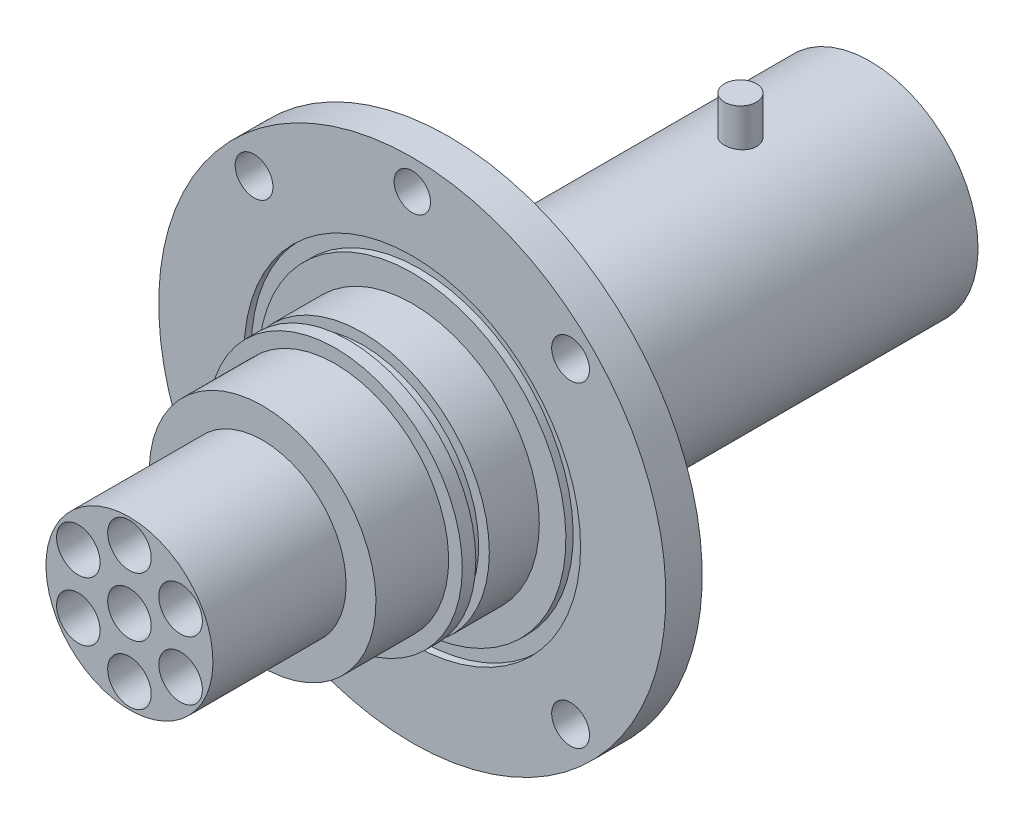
ISO-10303-21;
HEADER;
FILE_DESCRIPTION(('STEP AP214'),'2;1');
FILE_NAME('part.step','',(''),(''),'','','');
FILE_SCHEMA(('AUTOMOTIVE_DESIGN { 1 0 10303 214 1 1 1 1 }'));
ENDSEC;
DATA;
#1=APPLICATION_CONTEXT('core data for automotive mechanical design processes');
#2=APPLICATION_PROTOCOL_DEFINITION('international standard','automotive_design',2000,#1);
#3=PRODUCT_CONTEXT('',#1,'mechanical');
#4=PRODUCT('Part','Part','',(#3));
#5=PRODUCT_RELATED_PRODUCT_CATEGORY('part','',(#4));
#6=PRODUCT_DEFINITION_FORMATION('','',#4);
#7=PRODUCT_DEFINITION_CONTEXT('part definition',#1,'design');
#8=PRODUCT_DEFINITION('design','',#6,#7);
#9=PRODUCT_DEFINITION_SHAPE('','',#8);
#10=(LENGTH_UNIT() NAMED_UNIT(*) SI_UNIT(.MILLI.,.METRE.));
#11=(NAMED_UNIT(*) PLANE_ANGLE_UNIT() SI_UNIT($,.RADIAN.));
#12=(NAMED_UNIT(*) SI_UNIT($,.STERADIAN.) SOLID_ANGLE_UNIT());
#13=UNCERTAINTY_MEASURE_WITH_UNIT(LENGTH_MEASURE(1.E-05),#10,'distance_accuracy_value','');
#14=(GEOMETRIC_REPRESENTATION_CONTEXT(3) GLOBAL_UNCERTAINTY_ASSIGNED_CONTEXT((#13)) GLOBAL_UNIT_ASSIGNED_CONTEXT((#10,
#11,#12)) REPRESENTATION_CONTEXT('',''));
#15=CARTESIAN_POINT('',(0.,0.,0.));
#16=DIRECTION('',(0.,0.,1.));
#17=DIRECTION('',(1.,0.,0.));
#18=AXIS2_PLACEMENT_3D('',#15,#16,#17);
#19=CARTESIAN_POINT('',(0.,0.,0.));
#20=DIRECTION('',(0.,0.,-1.));
#21=DIRECTION('',(0.,1.,0.));
#22=AXIS2_PLACEMENT_3D('',#19,#20,#21);
#23=CYLINDRICAL_SURFACE('',#22,18.8722);
#24=CARTESIAN_POINT('',(0.,0.,-80.01));
#25=DIRECTION('',(0.,0.,-1.));
#26=DIRECTION('',(0.,1.,0.));
#27=AXIS2_PLACEMENT_3D('',#24,#25,#26);
#28=CIRCLE('',#27,18.8722);
#29=CARTESIAN_POINT('',(0.,18.8722,-80.01));
#30=VERTEX_POINT('',#29);
#31=EDGE_CURVE('E78',#30,#30,#28,.T.);
#32=ORIENTED_EDGE('',*,*,#31,.F.);
#33=EDGE_LOOP('',(#32));
#34=FACE_BOUND('',#33,.T.);
#35=CARTESIAN_POINT('',(0.,0.,-14.6812));
#36=DIRECTION('',(0.,0.,-1.));
#37=DIRECTION('',(0.,1.,0.));
#38=AXIS2_PLACEMENT_3D('',#35,#36,#37);
#39=CIRCLE('',#38,18.8722);
#40=CARTESIAN_POINT('',(0.,18.8722,-14.6812));
#41=VERTEX_POINT('',#40);
#42=EDGE_CURVE('E81',#41,#41,#39,.T.);
#43=ORIENTED_EDGE('',*,*,#42,.T.);
#44=EDGE_LOOP('',(#43));
#45=FACE_BOUND('',#44,.T.);
#46=CARTESIAN_POINT('',(0.,18.8722,-54.5592));
#47=CARTESIAN_POINT('',(-0.15602528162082,18.8721975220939,-54.55920645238));
#48=CARTESIAN_POINT('',(-0.312141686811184,18.8702448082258,-54.5723134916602));
#49=CARTESIAN_POINT('',(-0.62001245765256,18.8626429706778,-54.6243830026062));
#50=CARTESIAN_POINT('',(-0.771762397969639,18.8569902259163,-54.6633708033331));
#51=CARTESIAN_POINT('',(-1.06640004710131,18.8426237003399,-54.7660127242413));
#52=CARTESIAN_POINT('',(-1.20929429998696,18.8339122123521,-54.8296483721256));
#53=CARTESIAN_POINT('',(-1.48235401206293,18.8143913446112,-54.9797348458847));
#54=CARTESIAN_POINT('',(-1.61252127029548,18.8035822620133,-55.0661824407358));
#55=CARTESIAN_POINT('',(-1.85744592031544,18.7809765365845,-55.2601407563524));
#56=CARTESIAN_POINT('',(-1.97209231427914,18.7691736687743,-55.3677909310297));
#57=CARTESIAN_POINT('',(-2.18176331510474,18.745959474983,-55.6007985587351));
#58=CARTESIAN_POINT('',(-2.27678680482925,18.7345481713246,-55.726157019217));
#59=CARTESIAN_POINT('',(-2.44494522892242,18.7133486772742,-55.9917665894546));
#60=CARTESIAN_POINT('',(-2.51797304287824,18.7035685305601,-56.1320862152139));
#61=CARTESIAN_POINT('',(-2.63938260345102,18.6868234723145,-56.4231683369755));
#62=CARTESIAN_POINT('',(-2.68776565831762,18.6798584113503,-56.5739302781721));
#63=CARTESIAN_POINT('',(-2.75816815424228,18.6695932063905,-56.880451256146));
#64=CARTESIAN_POINT('',(-2.78037742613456,18.6662666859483,-57.036165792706));
#65=CARTESIAN_POINT('',(-2.79838993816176,18.6635750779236,-57.3491443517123));
#66=CARTESIAN_POINT('',(-2.794194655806,18.6642097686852,-57.506408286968));
#67=CARTESIAN_POINT('',(-2.75967233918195,18.669344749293,-57.8166820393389));
#68=CARTESIAN_POINT('',(-2.72955653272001,18.673813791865,-57.9697159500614));
#69=CARTESIAN_POINT('',(-2.64437860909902,18.686065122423,-58.268534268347));
#70=CARTESIAN_POINT('',(-2.58931580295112,18.6938475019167,-58.4143184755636));
#71=CARTESIAN_POINT('',(-2.45558660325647,18.7118832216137,-58.6951429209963));
#72=CARTESIAN_POINT('',(-2.37683054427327,18.7221459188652,-58.8301398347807));
#73=CARTESIAN_POINT('',(-2.19801431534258,18.7439791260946,-59.0850821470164));
#74=CARTESIAN_POINT('',(-2.09795278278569,18.7555497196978,-59.2050265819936));
#75=CARTESIAN_POINT('',(-1.87820558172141,18.7788331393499,-59.4276835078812));
#76=CARTESIAN_POINT('',(-1.75833826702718,18.7905462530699,-59.5302167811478));
#77=CARTESIAN_POINT('',(-1.50300172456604,18.8126902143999,-59.7137382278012));
#78=CARTESIAN_POINT('',(-1.36753243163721,18.8231210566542,-59.7947263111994));
#79=CARTESIAN_POINT('',(-1.08468351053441,18.8415356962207,-59.9328668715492));
#80=CARTESIAN_POINT('',(-0.937297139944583,18.8495180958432,-59.9900057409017));
#81=CARTESIAN_POINT('',(-0.634876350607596,18.8621246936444,-60.0786712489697));
#82=CARTESIAN_POINT('',(-0.479842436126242,18.8667491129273,-60.110199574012));
#83=CARTESIAN_POINT('',(-0.168074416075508,18.8720894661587,-60.146511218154));
#84=CARTESIAN_POINT('',(-0.011369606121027,18.8728414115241,-60.1515409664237));
#85=CARTESIAN_POINT('',(0.300645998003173,18.8704500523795,-60.1353664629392));
#86=CARTESIAN_POINT('',(0.455956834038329,18.8673068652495,-60.1141630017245));
#87=CARTESIAN_POINT('',(0.760030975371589,18.8575006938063,-60.0463288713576));
#88=CARTESIAN_POINT('',(0.908821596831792,18.850854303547,-59.9998180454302));
#89=CARTESIAN_POINT('',(1.19649271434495,18.8347846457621,-59.8828156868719));
#90=CARTESIAN_POINT('',(1.33537275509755,18.8253612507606,-59.8123230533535));
#91=CARTESIAN_POINT('',(1.60036545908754,18.8046955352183,-59.6487784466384));
#92=CARTESIAN_POINT('',(1.72638049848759,18.7934407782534,-59.5555698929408));
#93=CARTESIAN_POINT('',(1.96106729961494,18.7704043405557,-59.3494575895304));
#94=CARTESIAN_POINT('',(2.06973808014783,18.7586226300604,-59.2365527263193));
#95=CARTESIAN_POINT('',(2.26754639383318,18.7357462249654,-58.9931566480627));
#96=CARTESIAN_POINT('',(2.35651888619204,18.7246578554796,-58.8625306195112));
#97=CARTESIAN_POINT('',(2.51125843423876,18.7045349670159,-58.5880428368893));
#98=CARTESIAN_POINT('',(2.57702610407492,18.6955003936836,-58.4441814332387));
#99=CARTESIAN_POINT('',(2.68323234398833,18.6805536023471,-58.1478021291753));
#100=CARTESIAN_POINT('',(2.72375828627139,18.6746306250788,-57.9953161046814));
#101=CARTESIAN_POINT('',(2.77860906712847,18.6665488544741,-57.6856081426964));
#102=CARTESIAN_POINT('',(2.7929356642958,18.6643898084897,-57.5283865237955));
#103=CARTESIAN_POINT('',(2.79494004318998,18.6640896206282,-57.215315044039));
#104=CARTESIAN_POINT('',(2.7828773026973,18.6659093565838,-57.0594668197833));
#105=CARTESIAN_POINT('',(2.73300091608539,18.6732767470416,-56.7520413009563));
#106=CARTESIAN_POINT('',(2.6951873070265,18.6788243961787,-56.6004640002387));
#107=CARTESIAN_POINT('',(2.59497345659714,18.6930089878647,-56.3059518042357));
#108=CARTESIAN_POINT('',(2.53259088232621,18.7016437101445,-56.1630107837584));
#109=CARTESIAN_POINT('',(2.38503568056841,18.7210323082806,-55.8895819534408));
#110=CARTESIAN_POINT('',(2.29986232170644,18.7317862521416,-55.7590945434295));
#111=CARTESIAN_POINT('',(2.10819884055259,18.7543275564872,-55.5129579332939));
#112=CARTESIAN_POINT('',(2.00151641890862,18.7661236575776,-55.397459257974));
#113=CARTESIAN_POINT('',(1.77026940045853,18.7893468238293,-55.1859108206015));
#114=CARTESIAN_POINT('',(1.64570064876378,18.8007738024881,-55.0898655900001));
#115=CARTESIAN_POINT('',(1.38143354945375,18.8220409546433,-54.9194924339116));
#116=CARTESIAN_POINT('',(1.24165776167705,18.8318723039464,-54.8452835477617));
#117=CARTESIAN_POINT('',(0.951547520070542,18.8487537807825,-54.7215060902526));
#118=CARTESIAN_POINT('',(0.801224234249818,18.8558067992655,-54.6719118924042));
#119=CARTESIAN_POINT('',(0.541847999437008,18.8647193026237,-54.6100753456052));
#120=CARTESIAN_POINT('',(0.434399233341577,18.8675102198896,-54.5910260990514));
#121=CARTESIAN_POINT('',(0.217981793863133,18.8712514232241,-54.5655862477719));
#122=CARTESIAN_POINT('',(0.109013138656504,18.8722017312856,-54.5591954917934));
#123=CARTESIAN_POINT('',(0.,18.8722,-54.5592));
#124=B_SPLINE_CURVE_WITH_KNOTS('',3,(#46,#47,#48,#49,#50,#51,#52,#53,#54,#55,#56,#57,#58,#59,
#60,#61,#62,#63,#64,#65,#66,#67,#68,#69,#70,#71,#72,#73,#74,#75,#76,#77,#78,#79,#80,#81,#82,#83,
#84,#85,#86,#87,#88,#89,#90,#91,#92,#93,#94,#95,#96,#97,#98,#99,#100,#101,#102,#103,#104,#105,
#106,#107,#108,#109,#110,#111,#112,#113,#114,#115,#116,#117,#118,#119,#120,#121,#122,#123),
.UNSPECIFIED.,.T.,.F.,(4,2,2,2,2,2,2,2,2,2,2,2,2,2,2,2,2,2,2,2,2,2,2,2,2,2,2,2,2,2,2,2,2,2,2,2,
2,2,4),(0.,0.467677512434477,0.935813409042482,1.40359913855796,1.87131864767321,
2.34222387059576,2.81315589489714,3.28634562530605,3.75951023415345,4.22922157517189,
4.69890663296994,5.1648000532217,5.63070634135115,6.0983984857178,6.56612055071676,
7.03839822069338,7.5106778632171,7.98322660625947,8.45574423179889,8.92385972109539,
9.39196110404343,9.85786484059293,10.3237899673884,10.7930223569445,11.2622812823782,
11.7353344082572,12.2083750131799,12.6797689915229,13.1511313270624,13.6178797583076,
14.0846275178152,14.5510402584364,15.0174679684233,15.4882670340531,15.9591756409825,
16.4326057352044,16.9055418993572,17.2323069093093,17.5590680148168),.UNSPECIFIED.);
#125=CARTESIAN_POINT('',(0.,18.8722,-54.5592));
#126=VERTEX_POINT('',#125);
#127=EDGE_CURVE('E54',#126,#126,#124,.T.);
#128=ORIENTED_EDGE('',*,*,#127,.T.);
#129=EDGE_LOOP('',(#128));
#130=FACE_BOUND('',#129,.T.);
#131=ADVANCED_FACE('F34',(#34,#45,#130),#23,.T.);
#132=CARTESIAN_POINT('',(0.,19.812,26.162));
#133=DIRECTION('',(0.,0.,1.));
#134=DIRECTION('',(0.,-1.,0.));
#135=AXIS2_PLACEMENT_3D('',#132,#133,#134);
#136=PLANE('',#135);
#137=CARTESIAN_POINT('',(0.,0.,26.162));
#138=DIRECTION('',(0.,0.,1.));
#139=DIRECTION('',(0.,-1.,0.));
#140=AXIS2_PLACEMENT_3D('',#137,#138,#139);
#141=CIRCLE('',#140,14.5927470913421);
#142=CARTESIAN_POINT('',(0.,-14.5927470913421,26.162));
#143=VERTEX_POINT('',#142);
#144=EDGE_CURVE('E10',#143,#143,#141,.T.);
#145=ORIENTED_EDGE('',*,*,#144,.F.);
#146=EDGE_LOOP('',(#145));
#147=FACE_BOUND('',#146,.T.);
#148=CARTESIAN_POINT('',(0.,0.,26.162));
#149=DIRECTION('',(0.,0.,-1.));
#150=DIRECTION('',(0.,1.,0.));
#151=AXIS2_PLACEMENT_3D('',#148,#149,#150);
#152=CIRCLE('',#151,19.812);
#153=CARTESIAN_POINT('',(0.,19.812,26.162));
#154=VERTEX_POINT('',#153);
#155=EDGE_CURVE('E46',#154,#154,#152,.T.);
#156=ORIENTED_EDGE('',*,*,#155,.F.);
#157=EDGE_LOOP('',(#156));
#158=FACE_BOUND('',#157,.T.);
#159=ADVANCED_FACE('F36',(#147,#158),#136,.T.);
#160=CARTESIAN_POINT('',(0.,0.,0.));
#161=DIRECTION('',(0.,0.,-1.));
#162=DIRECTION('',(0.,1.,0.));
#163=AXIS2_PLACEMENT_3D('',#160,#161,#162);
#164=CYLINDRICAL_SURFACE('',#163,19.812);
#165=ORIENTED_EDGE('',*,*,#155,.T.);
#166=EDGE_LOOP('',(#165));
#167=FACE_BOUND('',#166,.T.);
#168=CARTESIAN_POINT('',(0.,0.,13.462));
#169=DIRECTION('',(0.,0.,-1.));
#170=DIRECTION('',(0.,1.,0.));
#171=AXIS2_PLACEMENT_3D('',#168,#169,#170);
#172=CIRCLE('',#171,19.812);
#173=CARTESIAN_POINT('',(0.,19.812,13.462));
#174=VERTEX_POINT('',#173);
#175=EDGE_CURVE('E126',#174,#174,#172,.T.);
#176=ORIENTED_EDGE('',*,*,#175,.F.);
#177=EDGE_LOOP('',(#176));
#178=FACE_BOUND('',#177,.T.);
#179=ADVANCED_FACE('F205',(#167,#178),#164,.T.);
#180=CARTESIAN_POINT('',(0.,22.1996,13.462));
#181=DIRECTION('',(0.,0.,1.));
#182=DIRECTION('',(0.,-1.,0.));
#183=AXIS2_PLACEMENT_3D('',#180,#181,#182);
#184=PLANE('',#183);
#185=ORIENTED_EDGE('',*,*,#175,.T.);
#186=EDGE_LOOP('',(#185));
#187=FACE_BOUND('',#186,.T.);
#188=CARTESIAN_POINT('',(0.,0.,13.462));
#189=DIRECTION('',(0.,0.,-1.));
#190=DIRECTION('',(0.,1.,0.));
#191=AXIS2_PLACEMENT_3D('',#188,#189,#190);
#192=CIRCLE('',#191,22.1996);
#193=CARTESIAN_POINT('',(0.,22.1996,13.462));
#194=VERTEX_POINT('',#193);
#195=EDGE_CURVE('E123',#194,#194,#192,.T.);
#196=ORIENTED_EDGE('',*,*,#195,.F.);
#197=EDGE_LOOP('',(#196));
#198=FACE_BOUND('',#197,.T.);
#199=ADVANCED_FACE('F804',(#187,#198),#184,.T.);
#200=CARTESIAN_POINT('',(0.,0.,0.));
#201=DIRECTION('',(0.,0.,-1.));
#202=DIRECTION('',(0.,1.,0.));
#203=AXIS2_PLACEMENT_3D('',#200,#201,#202);
#204=CYLINDRICAL_SURFACE('',#203,22.1996);
#205=ORIENTED_EDGE('',*,*,#195,.T.);
#206=EDGE_LOOP('',(#205));
#207=FACE_BOUND('',#206,.T.);
#208=CARTESIAN_POINT('',(0.,0.,11.0998));
#209=DIRECTION('',(0.,0.,-1.));
#210=DIRECTION('',(0.,1.,0.));
#211=AXIS2_PLACEMENT_3D('',#208,#209,#210);
#212=CIRCLE('',#211,22.1996);
#213=CARTESIAN_POINT('',(0.,22.1996,11.0998));
#214=VERTEX_POINT('',#213);
#215=EDGE_CURVE('E120',#214,#214,#212,.T.);
#216=ORIENTED_EDGE('',*,*,#215,.F.);
#217=EDGE_LOOP('',(#216));
#218=FACE_BOUND('',#217,.T.);
#219=ADVANCED_FACE('F794',(#207,#218),#204,.T.);
#220=CARTESIAN_POINT('',(0.,20.3356794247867,11.0998));
#221=DIRECTION('',(0.,0.,-1.));
#222=DIRECTION('',(0.,1.,0.));
#223=AXIS2_PLACEMENT_3D('',#220,#221,#222);
#224=PLANE('',#223);
#225=ORIENTED_EDGE('',*,*,#215,.T.);
#226=EDGE_LOOP('',(#225));
#227=FACE_BOUND('',#226,.T.);
#228=CARTESIAN_POINT('',(0.,0.,11.0998));
#229=DIRECTION('',(0.,0.,-1.));
#230=DIRECTION('',(0.,1.,0.));
#231=AXIS2_PLACEMENT_3D('',#228,#229,#230);
#232=CIRCLE('',#231,20.3356794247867);
#233=CARTESIAN_POINT('',(0.,20.3356794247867,11.0998));
#234=VERTEX_POINT('',#233);
#235=EDGE_CURVE('E117',#234,#234,#232,.T.);
#236=ORIENTED_EDGE('',*,*,#235,.F.);
#237=EDGE_LOOP('',(#236));
#238=FACE_BOUND('',#237,.T.);
#239=ADVANCED_FACE('F784',(#227,#238),#224,.T.);
#240=CARTESIAN_POINT('',(0.,0.,0.));
#241=DIRECTION('',(0.,0.,-1.));
#242=DIRECTION('',(0.,1.,0.));
#243=AXIS2_PLACEMENT_3D('',#240,#241,#242);
#244=CYLINDRICAL_SURFACE('',#243,20.3356794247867);
#245=ORIENTED_EDGE('',*,*,#235,.T.);
#246=EDGE_LOOP('',(#245));
#247=FACE_BOUND('',#246,.T.);
#248=CARTESIAN_POINT('',(0.,0.,8.7376));
#249=DIRECTION('',(0.,0.,-1.));
#250=DIRECTION('',(0.,1.,0.));
#251=AXIS2_PLACEMENT_3D('',#248,#249,#250);
#252=CIRCLE('',#251,20.3356794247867);
#253=CARTESIAN_POINT('',(0.,20.3356794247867,8.7376));
#254=VERTEX_POINT('',#253);
#255=EDGE_CURVE('E114',#254,#254,#252,.T.);
#256=ORIENTED_EDGE('',*,*,#255,.F.);
#257=EDGE_LOOP('',(#256));
#258=FACE_BOUND('',#257,.T.);
#259=ADVANCED_FACE('F774',(#247,#258),#244,.T.);
#260=CARTESIAN_POINT('',(0.,22.1996,8.7376));
#261=DIRECTION('',(0.,0.,1.));
#262=DIRECTION('',(0.,-1.,0.));
#263=AXIS2_PLACEMENT_3D('',#260,#261,#262);
#264=PLANE('',#263);
#265=ORIENTED_EDGE('',*,*,#255,.T.);
#266=EDGE_LOOP('',(#265));
#267=FACE_BOUND('',#266,.T.);
#268=CARTESIAN_POINT('',(0.,0.,8.7376));
#269=DIRECTION('',(0.,0.,-1.));
#270=DIRECTION('',(0.,1.,0.));
#271=AXIS2_PLACEMENT_3D('',#268,#269,#270);
#272=CIRCLE('',#271,22.1996);
#273=CARTESIAN_POINT('',(0.,22.1996,8.7376));
#274=VERTEX_POINT('',#273);
#275=EDGE_CURVE('E111',#274,#274,#272,.T.);
#276=ORIENTED_EDGE('',*,*,#275,.F.);
#277=EDGE_LOOP('',(#276));
#278=FACE_BOUND('',#277,.T.);
#279=ADVANCED_FACE('F764',(#267,#278),#264,.T.);
#280=CARTESIAN_POINT('',(0.,0.,0.));
#281=DIRECTION('',(0.,0.,-1.));
#282=DIRECTION('',(0.,1.,0.));
#283=AXIS2_PLACEMENT_3D('',#280,#281,#282);
#284=CYLINDRICAL_SURFACE('',#283,22.1996);
#285=ORIENTED_EDGE('',*,*,#275,.T.);
#286=EDGE_LOOP('',(#285));
#287=FACE_BOUND('',#286,.T.);
#288=CARTESIAN_POINT('',(0.,0.,0.));
#289=DIRECTION('',(0.,0.,-1.));
#290=DIRECTION('',(0.,1.,0.));
#291=AXIS2_PLACEMENT_3D('',#288,#289,#290);
#292=CIRCLE('',#291,22.1996);
#293=CARTESIAN_POINT('',(0.,22.1996,0.));
#294=VERTEX_POINT('',#293);
#295=EDGE_CURVE('E108',#294,#294,#292,.T.);
#296=ORIENTED_EDGE('',*,*,#295,.F.);
#297=EDGE_LOOP('',(#296));
#298=FACE_BOUND('',#297,.T.);
#299=ADVANCED_FACE('F754',(#287,#298),#284,.T.);
#300=CARTESIAN_POINT('',(0.,22.1996,0.));
#301=DIRECTION('',(0.,0.,1.));
#302=DIRECTION('',(0.,-1.,0.));
#303=AXIS2_PLACEMENT_3D('',#300,#301,#302);
#304=PLANE('',#303);
#305=ORIENTED_EDGE('',*,*,#295,.T.);
#306=EDGE_LOOP('',(#305));
#307=FACE_BOUND('',#306,.T.);
#308=CARTESIAN_POINT('',(0.,0.,0.));
#309=DIRECTION('',(0.,0.,-1.));
#310=DIRECTION('',(0.,1.,0.));
#311=AXIS2_PLACEMENT_3D('',#308,#309,#310);
#312=CIRCLE('',#311,26.8478);
#313=CARTESIAN_POINT('',(0.,26.8478,0.));
#314=VERTEX_POINT('',#313);
#315=EDGE_CURVE('E105',#314,#314,#312,.T.);
#316=ORIENTED_EDGE('',*,*,#315,.F.);
#317=EDGE_LOOP('',(#316));
#318=FACE_BOUND('',#317,.T.);
#319=ADVANCED_FACE('F744',(#307,#318),#304,.T.);
#320=CARTESIAN_POINT('',(0.,0.,0.));
#321=DIRECTION('',(0.,0.,-1.));
#322=DIRECTION('',(0.,1.,0.));
#323=AXIS2_PLACEMENT_3D('',#320,#321,#322);
#324=CYLINDRICAL_SURFACE('',#323,26.8478);
#325=ORIENTED_EDGE('',*,*,#315,.T.);
#326=EDGE_LOOP('',(#325));
#327=FACE_BOUND('',#326,.T.);
#328=CARTESIAN_POINT('',(0.,0.,-1.27));
#329=DIRECTION('',(0.,0.,-1.));
#330=DIRECTION('',(0.,1.,0.));
#331=AXIS2_PLACEMENT_3D('',#328,#329,#330);
#332=CIRCLE('',#331,26.8478);
#333=CARTESIAN_POINT('',(0.,26.8478,-1.27));
#334=VERTEX_POINT('',#333);
#335=EDGE_CURVE('E102',#334,#334,#332,.T.);
#336=ORIENTED_EDGE('',*,*,#335,.F.);
#337=EDGE_LOOP('',(#336));
#338=FACE_BOUND('',#337,.T.);
#339=ADVANCED_FACE('F734',(#327,#338),#324,.T.);
#340=CARTESIAN_POINT('',(0.,29.4132,-1.27));
#341=DIRECTION('',(0.,0.,1.));
#342=DIRECTION('',(0.,-1.,0.));
#343=AXIS2_PLACEMENT_3D('',#340,#341,#342);
#344=PLANE('',#343);
#345=ORIENTED_EDGE('',*,*,#335,.T.);
#346=EDGE_LOOP('',(#345));
#347=FACE_BOUND('',#346,.T.);
#348=CARTESIAN_POINT('',(0.,0.,-1.27));
#349=DIRECTION('',(0.,0.,-1.));
#350=DIRECTION('',(0.,1.,0.));
#351=AXIS2_PLACEMENT_3D('',#348,#349,#350);
#352=CIRCLE('',#351,29.4132);
#353=CARTESIAN_POINT('',(0.,29.4132,-1.27));
#354=VERTEX_POINT('',#353);
#355=EDGE_CURVE('E99',#354,#354,#352,.T.);
#356=ORIENTED_EDGE('',*,*,#355,.F.);
#357=EDGE_LOOP('',(#356));
#358=FACE_BOUND('',#357,.T.);
#359=ADVANCED_FACE('F724',(#347,#358),#344,.T.);
#360=CARTESIAN_POINT('',(0.,0.,0.));
#361=DIRECTION('',(0.,0.,-1.));
#362=DIRECTION('',(0.,1.,0.));
#363=AXIS2_PLACEMENT_3D('',#360,#361,#362);
#364=CYLINDRICAL_SURFACE('',#363,29.4132);
#365=ORIENTED_EDGE('',*,*,#355,.T.);
#366=EDGE_LOOP('',(#365));
#367=FACE_BOUND('',#366,.T.);
#368=CARTESIAN_POINT('',(0.,0.,0.));
#369=DIRECTION('',(0.,0.,-1.));
#370=DIRECTION('',(0.,1.,0.));
#371=AXIS2_PLACEMENT_3D('',#368,#369,#370);
#372=CIRCLE('',#371,29.4132);
#373=CARTESIAN_POINT('',(0.,29.4132,0.));
#374=VERTEX_POINT('',#373);
#375=EDGE_CURVE('E96',#374,#374,#372,.T.);
#376=ORIENTED_EDGE('',*,*,#375,.F.);
#377=EDGE_LOOP('',(#376));
#378=FACE_BOUND('',#377,.T.);
#379=ADVANCED_FACE('F689',(#367,#378),#364,.F.);
#380=CARTESIAN_POINT('',(0.,29.4132,0.));
#381=DIRECTION('',(0.,0.,1.));
#382=DIRECTION('',(0.,-1.,0.));
#383=AXIS2_PLACEMENT_3D('',#380,#381,#382);
#384=PLANE('',#383);
#385=CARTESIAN_POINT('',(-27.6581888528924,27.6581888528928,0.));
#386=DIRECTION('',(0.,0.,1.));
#387=DIRECTION('',(1.,0.,0.));
#388=AXIS2_PLACEMENT_3D('',#385,#386,#387);
#389=CIRCLE('',#388,3.302);
#390=CARTESIAN_POINT('',(-24.3561888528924,27.6581888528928,0.));
#391=VERTEX_POINT('',#390);
#392=EDGE_CURVE('E55',#391,#391,#389,.T.);
#393=ORIENTED_EDGE('',*,*,#392,.F.);
#394=EDGE_LOOP('',(#393));
#395=FACE_BOUND('',#394,.T.);
#396=CARTESIAN_POINT('',(-27.6571888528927,-27.6591888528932,0.));
#397=DIRECTION('',(0.,0.,1.));
#398=DIRECTION('',(1.,0.,0.));
#399=AXIS2_PLACEMENT_3D('',#396,#397,#398);
#400=CIRCLE('',#399,3.302);
#401=CARTESIAN_POINT('',(-24.3551888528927,-27.6591888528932,0.));
#402=VERTEX_POINT('',#401);
#403=EDGE_CURVE('E59',#402,#402,#400,.T.);
#404=ORIENTED_EDGE('',*,*,#403,.F.);
#405=EDGE_LOOP('',(#404));
#406=FACE_BOUND('',#405,.T.);
#407=CARTESIAN_POINT('',(27.6601888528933,-27.6581888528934,0.));
#408=DIRECTION('',(0.,0.,1.));
#409=DIRECTION('',(1.,0.,0.));
#410=AXIS2_PLACEMENT_3D('',#407,#408,#409);
#411=CIRCLE('',#410,3.302);
#412=CARTESIAN_POINT('',(30.9621888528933,-27.6581888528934,0.));
#413=VERTEX_POINT('',#412);
#414=EDGE_CURVE('E63',#413,#413,#411,.T.);
#415=ORIENTED_EDGE('',*,*,#414,.F.);
#416=EDGE_LOOP('',(#415));
#417=FACE_BOUND('',#416,.T.);
#418=CARTESIAN_POINT('',(27.6591888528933,27.6591888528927,0.));
#419=DIRECTION('',(0.,0.,1.));
#420=DIRECTION('',(1.,0.,0.));
#421=AXIS2_PLACEMENT_3D('',#418,#419,#420);
#422=CIRCLE('',#421,3.302);
#423=CARTESIAN_POINT('',(30.9611888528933,27.6591888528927,0.));
#424=VERTEX_POINT('',#423);
#425=EDGE_CURVE('E67',#424,#424,#422,.T.);
#426=ORIENTED_EDGE('',*,*,#425,.F.);
#427=EDGE_LOOP('',(#426));
#428=FACE_BOUND('',#427,.T.);
#429=CARTESIAN_POINT('',(0.,39.116,0.));
#430=DIRECTION('',(0.,0.,1.));
#431=DIRECTION('',(1.,0.,0.));
#432=AXIS2_PLACEMENT_3D('',#429,#430,#431);
#433=CIRCLE('',#432,3.175);
#434=CARTESIAN_POINT('',(3.175,39.116,0.));
#435=VERTEX_POINT('',#434);
#436=EDGE_CURVE('E71',#435,#435,#433,.T.);
#437=ORIENTED_EDGE('',*,*,#436,.F.);
#438=EDGE_LOOP('',(#437));
#439=FACE_BOUND('',#438,.T.);
#440=ORIENTED_EDGE('',*,*,#375,.T.);
#441=EDGE_LOOP('',(#440));
#442=FACE_BOUND('',#441,.T.);
#443=CARTESIAN_POINT('',(0.,0.,0.));
#444=DIRECTION('',(0.,0.,-1.));
#445=DIRECTION('',(0.,1.,0.));
#446=AXIS2_PLACEMENT_3D('',#443,#444,#445);
#447=CIRCLE('',#446,44.323);
#448=CARTESIAN_POINT('',(0.,44.323,0.));
#449=VERTEX_POINT('',#448);
#450=EDGE_CURVE('E93',#449,#449,#447,.T.);
#451=ORIENTED_EDGE('',*,*,#450,.F.);
#452=EDGE_LOOP('',(#451));
#453=FACE_BOUND('',#452,.T.);
#454=ADVANCED_FACE('F685',(#395,#406,#417,#428,#439,#442,#453),#384,.T.);
#455=CARTESIAN_POINT('',(0.,0.,0.));
#456=DIRECTION('',(0.,0.,-1.));
#457=DIRECTION('',(0.,1.,0.));
#458=AXIS2_PLACEMENT_3D('',#455,#456,#457);
#459=CYLINDRICAL_SURFACE('',#458,44.323);
#460=ORIENTED_EDGE('',*,*,#450,.T.);
#461=EDGE_LOOP('',(#460));
#462=FACE_BOUND('',#461,.T.);
#463=CARTESIAN_POINT('',(0.,0.,-6.35));
#464=DIRECTION('',(0.,0.,-1.));
#465=DIRECTION('',(0.,1.,0.));
#466=AXIS2_PLACEMENT_3D('',#463,#464,#465);
#467=CIRCLE('',#466,44.323);
#468=CARTESIAN_POINT('',(0.,44.323,-6.35));
#469=VERTEX_POINT('',#468);
#470=EDGE_CURVE('E90',#469,#469,#467,.T.);
#471=ORIENTED_EDGE('',*,*,#470,.F.);
#472=EDGE_LOOP('',(#471));
#473=FACE_BOUND('',#472,.T.);
#474=ADVANCED_FACE('F675',(#462,#473),#459,.T.);
#475=CARTESIAN_POINT('',(0.,44.323,-6.35));
#476=DIRECTION('',(0.,0.,-1.));
#477=DIRECTION('',(0.,1.,0.));
#478=AXIS2_PLACEMENT_3D('',#475,#476,#477);
#479=PLANE('',#478);
#480=CARTESIAN_POINT('',(-27.6581888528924,27.6581888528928,-6.34999999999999));
#481=DIRECTION('',(0.,0.,-1.));
#482=DIRECTION('',(0.,1.,0.));
#483=AXIS2_PLACEMENT_3D('',#480,#481,#482);
#484=CIRCLE('',#483,3.302);
#485=CARTESIAN_POINT('',(-27.6581888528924,30.9601888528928,-6.34999999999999));
#486=VERTEX_POINT('',#485);
#487=EDGE_CURVE('E58',#486,#486,#484,.T.);
#488=ORIENTED_EDGE('',*,*,#487,.F.);
#489=EDGE_LOOP('',(#488));
#490=FACE_BOUND('',#489,.T.);
#491=CARTESIAN_POINT('',(-27.6571888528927,-27.6591888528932,-6.35000000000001));
#492=DIRECTION('',(0.,0.,-1.));
#493=DIRECTION('',(0.,1.,0.));
#494=AXIS2_PLACEMENT_3D('',#491,#492,#493);
#495=CIRCLE('',#494,3.302);
#496=CARTESIAN_POINT('',(-27.6571888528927,-24.3571888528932,-6.35000000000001));
#497=VERTEX_POINT('',#496);
#498=EDGE_CURVE('E62',#497,#497,#495,.T.);
#499=ORIENTED_EDGE('',*,*,#498,.F.);
#500=EDGE_LOOP('',(#499));
#501=FACE_BOUND('',#500,.T.);
#502=CARTESIAN_POINT('',(27.6601888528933,-27.6581888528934,-6.35000000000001));
#503=DIRECTION('',(0.,0.,-1.));
#504=DIRECTION('',(0.,1.,0.));
#505=AXIS2_PLACEMENT_3D('',#502,#503,#504);
#506=CIRCLE('',#505,3.302);
#507=CARTESIAN_POINT('',(27.6601888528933,-24.3561888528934,-6.35000000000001));
#508=VERTEX_POINT('',#507);
#509=EDGE_CURVE('E66',#508,#508,#506,.T.);
#510=ORIENTED_EDGE('',*,*,#509,.F.);
#511=EDGE_LOOP('',(#510));
#512=FACE_BOUND('',#511,.T.);
#513=CARTESIAN_POINT('',(27.6591888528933,27.6591888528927,-6.34999999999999));
#514=DIRECTION('',(0.,0.,-1.));
#515=DIRECTION('',(0.,1.,0.));
#516=AXIS2_PLACEMENT_3D('',#513,#514,#515);
#517=CIRCLE('',#516,3.302);
#518=CARTESIAN_POINT('',(27.6591888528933,30.9611888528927,-6.34999999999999));
#519=VERTEX_POINT('',#518);
#520=EDGE_CURVE('E70',#519,#519,#517,.T.);
#521=ORIENTED_EDGE('',*,*,#520,.F.);
#522=EDGE_LOOP('',(#521));
#523=FACE_BOUND('',#522,.T.);
#524=CARTESIAN_POINT('',(0.,39.116,-6.34999999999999));
#525=DIRECTION('',(0.,0.,-1.));
#526=DIRECTION('',(0.,1.,0.));
#527=AXIS2_PLACEMENT_3D('',#524,#525,#526);
#528=CIRCLE('',#527,3.175);
#529=CARTESIAN_POINT('',(0.,42.291,-6.34999999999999));
#530=VERTEX_POINT('',#529);
#531=EDGE_CURVE('E74',#530,#530,#528,.T.);
#532=ORIENTED_EDGE('',*,*,#531,.F.);
#533=EDGE_LOOP('',(#532));
#534=FACE_BOUND('',#533,.T.);
#535=ORIENTED_EDGE('',*,*,#470,.T.);
#536=EDGE_LOOP('',(#535));
#537=FACE_BOUND('',#536,.T.);
#538=CARTESIAN_POINT('',(0.,0.,-6.35));
#539=DIRECTION('',(0.,0.,-1.));
#540=DIRECTION('',(0.,1.,0.));
#541=AXIS2_PLACEMENT_3D('',#538,#539,#540);
#542=CIRCLE('',#541,27.94);
#543=CARTESIAN_POINT('',(0.,27.94,-6.35));
#544=VERTEX_POINT('',#543);
#545=EDGE_CURVE('E87',#544,#544,#542,.T.);
#546=ORIENTED_EDGE('',*,*,#545,.F.);
#547=EDGE_LOOP('',(#546));
#548=FACE_BOUND('',#547,.T.);
#549=ADVANCED_FACE('F670',(#490,#501,#512,#523,#534,#537,#548),#479,.T.);
#550=CARTESIAN_POINT('',(0.,0.,0.));
#551=DIRECTION('',(0.,0.,-1.));
#552=DIRECTION('',(0.,1.,0.));
#553=AXIS2_PLACEMENT_3D('',#550,#551,#552);
#554=CYLINDRICAL_SURFACE('',#553,27.94);
#555=ORIENTED_EDGE('',*,*,#545,.T.);
#556=EDGE_LOOP('',(#555));
#557=FACE_BOUND('',#556,.T.);
#558=CARTESIAN_POINT('',(0.,0.,-14.6812));
#559=DIRECTION('',(0.,0.,-1.));
#560=DIRECTION('',(0.,1.,0.));
#561=AXIS2_PLACEMENT_3D('',#558,#559,#560);
#562=CIRCLE('',#561,27.94);
#563=CARTESIAN_POINT('',(0.,27.94,-14.6812));
#564=VERTEX_POINT('',#563);
#565=EDGE_CURVE('E84',#564,#564,#562,.T.);
#566=ORIENTED_EDGE('',*,*,#565,.F.);
#567=EDGE_LOOP('',(#566));
#568=FACE_BOUND('',#567,.T.);
#569=ADVANCED_FACE('F197',(#557,#568),#554,.T.);
#570=CARTESIAN_POINT('',(0.,27.94,-14.6812));
#571=DIRECTION('',(0.,0.,-1.));
#572=DIRECTION('',(0.,1.,0.));
#573=AXIS2_PLACEMENT_3D('',#570,#571,#572);
#574=PLANE('',#573);
#575=ORIENTED_EDGE('',*,*,#565,.T.);
#576=EDGE_LOOP('',(#575));
#577=FACE_BOUND('',#576,.T.);
#578=ORIENTED_EDGE('',*,*,#42,.F.);
#579=EDGE_LOOP('',(#578));
#580=FACE_BOUND('',#579,.T.);
#581=ADVANCED_FACE('F192',(#577,#580),#574,.T.);
#582=CARTESIAN_POINT('',(0.,18.8722,-80.01));
#583=DIRECTION('',(0.,0.,-1.));
#584=DIRECTION('',(0.,1.,0.));
#585=AXIS2_PLACEMENT_3D('',#582,#583,#584);
#586=PLANE('',#585);
#587=ORIENTED_EDGE('',*,*,#31,.T.);
#588=EDGE_LOOP('',(#587));
#589=FACE_BOUND('',#588,.T.);
#590=CARTESIAN_POINT('',(0.,0.,-80.01));
#591=DIRECTION('',(0.,0.,-1.));
#592=DIRECTION('',(0.,1.,0.));
#593=AXIS2_PLACEMENT_3D('',#590,#591,#592);
#594=CIRCLE('',#593,14.5927470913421);
#595=CARTESIAN_POINT('',(0.,14.5927470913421,-80.01));
#596=VERTEX_POINT('',#595);
#597=EDGE_CURVE('E75',#596,#596,#594,.T.);
#598=ORIENTED_EDGE('',*,*,#597,.F.);
#599=EDGE_LOOP('',(#598));
#600=FACE_BOUND('',#599,.T.);
#601=ADVANCED_FACE('F189',(#589,#600),#586,.T.);
#602=CARTESIAN_POINT('',(0.,0.,0.));
#603=DIRECTION('',(0.,0.,-1.));
#604=DIRECTION('',(0.,1.,0.));
#605=AXIS2_PLACEMENT_3D('',#602,#603,#604);
#606=CYLINDRICAL_SURFACE('',#605,14.5927470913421);
#607=CARTESIAN_POINT('',(0.,0.,-79.1519889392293));
#608=DIRECTION('',(0.,0.,-1.));
#609=DIRECTION('',(0.,1.,0.));
#610=AXIS2_PLACEMENT_3D('',#607,#608,#609);
#611=CIRCLE('',#610,14.5927470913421);
#612=CARTESIAN_POINT('',(0.,14.5927470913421,-79.1519889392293));
#613=VERTEX_POINT('',#612);
#614=EDGE_CURVE('E38',#613,#613,#611,.T.);
#615=ORIENTED_EDGE('',*,*,#614,.F.);
#616=EDGE_LOOP('',(#615));
#617=FACE_BOUND('',#616,.T.);
#618=ORIENTED_EDGE('',*,*,#597,.T.);
#619=EDGE_LOOP('',(#618));
#620=FACE_BOUND('',#619,.T.);
#621=ADVANCED_FACE('F179',(#617,#620),#606,.F.);
#622=CARTESIAN_POINT('',(0.,39.116,-80.01));
#623=DIRECTION('',(0.,0.,1.));
#624=DIRECTION('',(1.,0.,0.));
#625=AXIS2_PLACEMENT_3D('',#622,#623,#624);
#626=CYLINDRICAL_SURFACE('',#625,3.175);
#627=ORIENTED_EDGE('',*,*,#531,.T.);
#628=EDGE_LOOP('',(#627));
#629=FACE_BOUND('',#628,.T.);
#630=ORIENTED_EDGE('',*,*,#436,.T.);
#631=EDGE_LOOP('',(#630));
#632=FACE_BOUND('',#631,.T.);
#633=ADVANCED_FACE('F175',(#629,#632),#626,.F.);
#634=CARTESIAN_POINT('',(27.6591888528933,27.6591888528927,-80.01));
#635=DIRECTION('',(0.,0.,1.));
#636=DIRECTION('',(1.,0.,0.));
#637=AXIS2_PLACEMENT_3D('',#634,#635,#636);
#638=CYLINDRICAL_SURFACE('',#637,3.302);
#639=ORIENTED_EDGE('',*,*,#520,.T.);
#640=EDGE_LOOP('',(#639));
#641=FACE_BOUND('',#640,.T.);
#642=ORIENTED_EDGE('',*,*,#425,.T.);
#643=EDGE_LOOP('',(#642));
#644=FACE_BOUND('',#643,.T.);
#645=ADVANCED_FACE('F171',(#641,#644),#638,.F.);
#646=CARTESIAN_POINT('',(27.6601888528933,-27.6581888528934,-80.01));
#647=DIRECTION('',(0.,0.,1.));
#648=DIRECTION('',(1.,0.,0.));
#649=AXIS2_PLACEMENT_3D('',#646,#647,#648);
#650=CYLINDRICAL_SURFACE('',#649,3.302);
#651=ORIENTED_EDGE('',*,*,#509,.T.);
#652=EDGE_LOOP('',(#651));
#653=FACE_BOUND('',#652,.T.);
#654=ORIENTED_EDGE('',*,*,#414,.T.);
#655=EDGE_LOOP('',(#654));
#656=FACE_BOUND('',#655,.T.);
#657=ADVANCED_FACE('F167',(#653,#656),#650,.F.);
#658=CARTESIAN_POINT('',(-27.6571888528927,-27.6591888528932,-80.01));
#659=DIRECTION('',(0.,0.,1.));
#660=DIRECTION('',(1.,0.,0.));
#661=AXIS2_PLACEMENT_3D('',#658,#659,#660);
#662=CYLINDRICAL_SURFACE('',#661,3.302);
#663=ORIENTED_EDGE('',*,*,#498,.T.);
#664=EDGE_LOOP('',(#663));
#665=FACE_BOUND('',#664,.T.);
#666=ORIENTED_EDGE('',*,*,#403,.T.);
#667=EDGE_LOOP('',(#666));
#668=FACE_BOUND('',#667,.T.);
#669=ADVANCED_FACE('F163',(#665,#668),#662,.F.);
#670=CARTESIAN_POINT('',(-27.6581888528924,27.6581888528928,-80.01));
#671=DIRECTION('',(0.,0.,1.));
#672=DIRECTION('',(1.,0.,0.));
#673=AXIS2_PLACEMENT_3D('',#670,#671,#672);
#674=CYLINDRICAL_SURFACE('',#673,3.302);
#675=ORIENTED_EDGE('',*,*,#487,.T.);
#676=EDGE_LOOP('',(#675));
#677=FACE_BOUND('',#676,.T.);
#678=ORIENTED_EDGE('',*,*,#392,.T.);
#679=EDGE_LOOP('',(#678));
#680=FACE_BOUND('',#679,.T.);
#681=ADVANCED_FACE('F158',(#677,#680),#674,.F.);
#682=CARTESIAN_POINT('',(0.,25.4,-57.3532));
#683=DIRECTION('',(0.,-1.,0.));
#684=DIRECTION('',(0.,0.,-1.));
#685=AXIS2_PLACEMENT_3D('',#682,#683,#684);
#686=CYLINDRICAL_SURFACE('',#685,2.794);
#687=ORIENTED_EDGE('',*,*,#127,.F.);
#688=EDGE_LOOP('',(#687));
#689=FACE_BOUND('',#688,.T.);
#690=CARTESIAN_POINT('',(0.,25.4,-57.3532));
#691=DIRECTION('',(0.,1.,0.));
#692=DIRECTION('',(0.,0.,1.));
#693=AXIS2_PLACEMENT_3D('',#690,#691,#692);
#694=CIRCLE('',#693,2.794);
#695=CARTESIAN_POINT('',(0.,25.4,-54.5592));
#696=VERTEX_POINT('',#695);
#697=EDGE_CURVE('E51',#696,#696,#694,.T.);
#698=ORIENTED_EDGE('',*,*,#697,.F.);
#699=EDGE_LOOP('',(#698));
#700=FACE_BOUND('',#699,.T.);
#701=ADVANCED_FACE('F152',(#689,#700),#686,.T.);
#702=CARTESIAN_POINT('',(0.,25.4,-57.3532));
#703=DIRECTION('',(0.,1.,0.));
#704=DIRECTION('',(0.,0.,1.));
#705=AXIS2_PLACEMENT_3D('',#702,#703,#704);
#706=PLANE('',#705);
#707=ORIENTED_EDGE('',*,*,#697,.T.);
#708=EDGE_LOOP('',(#707));
#709=FACE_BOUND('',#708,.T.);
#710=ADVANCED_FACE('F157',(#709),#706,.T.);
#711=CARTESIAN_POINT('',(8.93629963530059,5.15937499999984,49.4355110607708));
#712=DIRECTION('',(0.,0.,-1.));
#713=DIRECTION('',(0.,1.,0.));
#714=AXIS2_PLACEMENT_3D('',#711,#712,#713);
#715=CYLINDRICAL_SURFACE('',#714,3.80622512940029);
#716=CARTESIAN_POINT('',(8.93629963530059,5.15937499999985,-6.12698893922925));
#717=DIRECTION('',(0.,0.,-1.));
#718=DIRECTION('',(0.,1.,0.));
#719=AXIS2_PLACEMENT_3D('',#716,#717,#718);
#720=CIRCLE('',#719,3.80622512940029);
#721=CARTESIAN_POINT('',(8.93629963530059,8.96560012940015,-6.12698893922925));
#722=VERTEX_POINT('',#721);
#723=EDGE_CURVE('E147',#722,#722,#720,.T.);
#724=ORIENTED_EDGE('',*,*,#723,.F.);
#725=EDGE_LOOP('',(#724));
#726=FACE_BOUND('',#725,.T.);
#727=CARTESIAN_POINT('',(8.93629963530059,5.15937499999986,-79.1519889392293));
#728=DIRECTION('',(0.,0.,-1.));
#729=DIRECTION('',(0.,1.,0.));
#730=AXIS2_PLACEMENT_3D('',#727,#728,#729);
#731=CIRCLE('',#730,3.80622512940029);
#732=CARTESIAN_POINT('',(8.93629963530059,8.96560012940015,-79.1519889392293));
#733=VERTEX_POINT('',#732);
#734=EDGE_CURVE('E332',#733,#733,#731,.T.);
#735=ORIENTED_EDGE('',*,*,#734,.T.);
#736=EDGE_LOOP('',(#735));
#737=FACE_BOUND('',#736,.T.);
#738=ADVANCED_FACE('F218',(#726,#737),#715,.F.);
#739=CARTESIAN_POINT('',(-3.50863459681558E-13,-10.31875,49.4355110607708));
#740=DIRECTION('',(0.,0.,-1.));
#741=DIRECTION('',(0.,1.,0.));
#742=AXIS2_PLACEMENT_3D('',#739,#740,#741);
#743=CYLINDRICAL_SURFACE('',#742,3.80622512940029);
#744=CARTESIAN_POINT('',(-3.50863459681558E-13,-10.31875,-6.12698893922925));
#745=DIRECTION('',(0.,0.,-1.));
#746=DIRECTION('',(0.,1.,0.));
#747=AXIS2_PLACEMENT_3D('',#744,#745,#746);
#748=CIRCLE('',#747,3.80622512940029);
#749=CARTESIAN_POINT('',(-3.50863459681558E-13,-6.51252487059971,-6.12698893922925));
#750=VERTEX_POINT('',#749);
#751=EDGE_CURVE('E290',#750,#750,#748,.T.);
#752=ORIENTED_EDGE('',*,*,#751,.F.);
#753=EDGE_LOOP('',(#752));
#754=FACE_BOUND('',#753,.T.);
#755=CARTESIAN_POINT('',(-3.50863459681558E-13,-10.31875,-79.1519889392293));
#756=DIRECTION('',(0.,0.,-1.));
#757=DIRECTION('',(0.,1.,0.));
#758=AXIS2_PLACEMENT_3D('',#755,#756,#757);
#759=CIRCLE('',#758,3.80622512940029);
#760=CARTESIAN_POINT('',(-3.50863459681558E-13,-6.5125248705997,-79.1519889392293));
#761=VERTEX_POINT('',#760);
#762=EDGE_CURVE('E331',#761,#761,#759,.T.);
#763=ORIENTED_EDGE('',*,*,#762,.T.);
#764=EDGE_LOOP('',(#763));
#765=FACE_BOUND('',#764,.T.);
#766=ADVANCED_FACE('F222',(#754,#765),#743,.F.);
#767=CARTESIAN_POINT('',(-8.93629963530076,5.15937500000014,49.4355110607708));
#768=DIRECTION('',(0.,0.,-1.));
#769=DIRECTION('',(0.,1.,0.));
#770=AXIS2_PLACEMENT_3D('',#767,#768,#769);
#771=CYLINDRICAL_SURFACE('',#770,3.8062251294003);
#772=CARTESIAN_POINT('',(-8.93629963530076,5.15937500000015,-6.12698893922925));
#773=DIRECTION('',(0.,0.,-1.));
#774=DIRECTION('',(0.,1.,0.));
#775=AXIS2_PLACEMENT_3D('',#772,#773,#774);
#776=CIRCLE('',#775,3.8062251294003);
#777=CARTESIAN_POINT('',(-8.93629963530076,8.96560012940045,-6.12698893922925));
#778=VERTEX_POINT('',#777);
#779=EDGE_CURVE('E298',#778,#778,#776,.T.);
#780=ORIENTED_EDGE('',*,*,#779,.F.);
#781=EDGE_LOOP('',(#780));
#782=FACE_BOUND('',#781,.T.);
#783=CARTESIAN_POINT('',(-8.93629963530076,5.15937500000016,-79.1519889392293));
#784=DIRECTION('',(0.,0.,-1.));
#785=DIRECTION('',(0.,1.,0.));
#786=AXIS2_PLACEMENT_3D('',#783,#784,#785);
#787=CIRCLE('',#786,3.8062251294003);
#788=CARTESIAN_POINT('',(-8.93629963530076,8.96560012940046,-79.1519889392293));
#789=VERTEX_POINT('',#788);
#790=EDGE_CURVE('E342',#789,#789,#787,.T.);
#791=ORIENTED_EDGE('',*,*,#790,.T.);
#792=EDGE_LOOP('',(#791));
#793=FACE_BOUND('',#792,.T.);
#794=ADVANCED_FACE('F229',(#782,#793),#771,.F.);
#795=CARTESIAN_POINT('',(0.,0.,49.4355110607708));
#796=DIRECTION('',(0.,0.,-1.));
#797=DIRECTION('',(0.,1.,0.));
#798=AXIS2_PLACEMENT_3D('',#795,#796,#797);
#799=CYLINDRICAL_SURFACE('',#798,3.80622512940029);
#800=CARTESIAN_POINT('',(0.,0.,-6.12698893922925));
#801=DIRECTION('',(0.,0.,-1.));
#802=DIRECTION('',(0.,1.,0.));
#803=AXIS2_PLACEMENT_3D('',#800,#801,#802);
#804=CIRCLE('',#803,3.80622512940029);
#805=CARTESIAN_POINT('',(0.,3.80622512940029,-6.12698893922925));
#806=VERTEX_POINT('',#805);
#807=EDGE_CURVE('E304',#806,#806,#804,.T.);
#808=ORIENTED_EDGE('',*,*,#807,.F.);
#809=EDGE_LOOP('',(#808));
#810=FACE_BOUND('',#809,.T.);
#811=CARTESIAN_POINT('',(0.,0.,-79.1519889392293));
#812=DIRECTION('',(0.,0.,-1.));
#813=DIRECTION('',(0.,1.,0.));
#814=AXIS2_PLACEMENT_3D('',#811,#812,#813);
#815=CIRCLE('',#814,3.80622512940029);
#816=CARTESIAN_POINT('',(0.,3.8062251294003,-79.1519889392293));
#817=VERTEX_POINT('',#816);
#818=EDGE_CURVE('E258',#817,#817,#815,.T.);
#819=ORIENTED_EDGE('',*,*,#818,.T.);
#820=EDGE_LOOP('',(#819));
#821=FACE_BOUND('',#820,.T.);
#822=ADVANCED_FACE('F363',(#810,#821),#799,.F.);
#823=CARTESIAN_POINT('',(0.,10.31875,49.4355110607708));
#824=DIRECTION('',(0.,0.,-1.));
#825=DIRECTION('',(0.,1.,0.));
#826=AXIS2_PLACEMENT_3D('',#823,#824,#825);
#827=CYLINDRICAL_SURFACE('',#826,3.80622512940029);
#828=CARTESIAN_POINT('',(0.,10.31875,-6.12698893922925));
#829=DIRECTION('',(0.,0.,-1.));
#830=DIRECTION('',(0.,1.,0.));
#831=AXIS2_PLACEMENT_3D('',#828,#829,#830);
#832=CIRCLE('',#831,3.80622512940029);
#833=CARTESIAN_POINT('',(0.,14.1249751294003,-6.12698893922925));
#834=VERTEX_POINT('',#833);
#835=EDGE_CURVE('E301',#834,#834,#832,.T.);
#836=ORIENTED_EDGE('',*,*,#835,.F.);
#837=EDGE_LOOP('',(#836));
#838=FACE_BOUND('',#837,.T.);
#839=CARTESIAN_POINT('',(0.,10.31875,-79.1519889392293));
#840=DIRECTION('',(0.,0.,-1.));
#841=DIRECTION('',(0.,1.,0.));
#842=AXIS2_PLACEMENT_3D('',#839,#840,#841);
#843=CIRCLE('',#842,3.80622512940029);
#844=CARTESIAN_POINT('',(0.,14.1249751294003,-79.1519889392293));
#845=VERTEX_POINT('',#844);
#846=EDGE_CURVE('E264',#845,#845,#843,.T.);
#847=ORIENTED_EDGE('',*,*,#846,.T.);
#848=EDGE_LOOP('',(#847));
#849=FACE_BOUND('',#848,.T.);
#850=ADVANCED_FACE('F347',(#838,#849),#827,.F.);
#851=CARTESIAN_POINT('',(-8.93629963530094,-5.15937499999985,49.4355110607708));
#852=DIRECTION('',(0.,0.,-1.));
#853=DIRECTION('',(0.,1.,0.));
#854=AXIS2_PLACEMENT_3D('',#851,#852,#853);
#855=CYLINDRICAL_SURFACE('',#854,3.80622512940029);
#856=CARTESIAN_POINT('',(-8.93629963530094,-5.15937499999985,-6.12698893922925));
#857=DIRECTION('',(0.,0.,-1.));
#858=DIRECTION('',(0.,1.,0.));
#859=AXIS2_PLACEMENT_3D('',#856,#857,#858);
#860=CIRCLE('',#859,3.80622512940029);
#861=CARTESIAN_POINT('',(-8.93629963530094,-1.35314987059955,-6.12698893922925));
#862=VERTEX_POINT('',#861);
#863=EDGE_CURVE('E294',#862,#862,#860,.T.);
#864=ORIENTED_EDGE('',*,*,#863,.F.);
#865=EDGE_LOOP('',(#864));
#866=FACE_BOUND('',#865,.T.);
#867=CARTESIAN_POINT('',(-8.93629963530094,-5.15937499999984,-79.1519889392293));
#868=DIRECTION('',(0.,0.,-1.));
#869=DIRECTION('',(0.,1.,0.));
#870=AXIS2_PLACEMENT_3D('',#867,#868,#869);
#871=CIRCLE('',#870,3.80622512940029);
#872=CARTESIAN_POINT('',(-8.93629963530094,-1.35314987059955,-79.1519889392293));
#873=VERTEX_POINT('',#872);
#874=EDGE_CURVE('E335',#873,#873,#871,.T.);
#875=ORIENTED_EDGE('',*,*,#874,.T.);
#876=EDGE_LOOP('',(#875));
#877=FACE_BOUND('',#876,.T.);
#878=ADVANCED_FACE('F326',(#866,#877),#855,.F.);
#879=CARTESIAN_POINT('',(8.93629963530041,-5.15937500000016,49.4355110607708));
#880=DIRECTION('',(0.,0.,-1.));
#881=DIRECTION('',(0.,1.,0.));
#882=AXIS2_PLACEMENT_3D('',#879,#880,#881);
#883=CYLINDRICAL_SURFACE('',#882,3.80622512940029);
#884=CARTESIAN_POINT('',(8.93629963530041,-5.15937500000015,-6.12698893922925));
#885=DIRECTION('',(0.,0.,-1.));
#886=DIRECTION('',(0.,1.,0.));
#887=AXIS2_PLACEMENT_3D('',#884,#885,#886);
#888=CIRCLE('',#887,3.80622512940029);
#889=CARTESIAN_POINT('',(8.93629963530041,-1.35314987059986,-6.12698893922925));
#890=VERTEX_POINT('',#889);
#891=EDGE_CURVE('E286',#890,#890,#888,.T.);
#892=ORIENTED_EDGE('',*,*,#891,.F.);
#893=EDGE_LOOP('',(#892));
#894=FACE_BOUND('',#893,.T.);
#895=CARTESIAN_POINT('',(8.93629963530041,-5.15937500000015,-79.1519889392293));
#896=DIRECTION('',(0.,0.,-1.));
#897=DIRECTION('',(0.,1.,0.));
#898=AXIS2_PLACEMENT_3D('',#895,#896,#897);
#899=CIRCLE('',#898,3.80622512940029);
#900=CARTESIAN_POINT('',(8.93629963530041,-1.35314987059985,-79.1519889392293));
#901=VERTEX_POINT('',#900);
#902=EDGE_CURVE('E329',#901,#901,#899,.T.);
#903=ORIENTED_EDGE('',*,*,#902,.T.);
#904=EDGE_LOOP('',(#903));
#905=FACE_BOUND('',#904,.T.);
#906=ADVANCED_FACE('F249',(#894,#905),#883,.F.);
#907=CARTESIAN_POINT('',(0.,0.,-79.1519889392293));
#908=DIRECTION('',(0.,0.,-1.));
#909=DIRECTION('',(0.,1.,0.));
#910=AXIS2_PLACEMENT_3D('',#907,#908,#909);
#911=PLANE('',#910);
#912=ORIENTED_EDGE('',*,*,#902,.F.);
#913=EDGE_LOOP('',(#912));
#914=FACE_BOUND('',#913,.T.);
#915=ORIENTED_EDGE('',*,*,#874,.F.);
#916=EDGE_LOOP('',(#915));
#917=FACE_BOUND('',#916,.T.);
#918=ORIENTED_EDGE('',*,*,#846,.F.);
#919=EDGE_LOOP('',(#918));
#920=FACE_BOUND('',#919,.T.);
#921=ORIENTED_EDGE('',*,*,#614,.T.);
#922=EDGE_LOOP('',(#921));
#923=FACE_BOUND('',#922,.T.);
#924=ORIENTED_EDGE('',*,*,#818,.F.);
#925=EDGE_LOOP('',(#924));
#926=FACE_BOUND('',#925,.T.);
#927=ORIENTED_EDGE('',*,*,#790,.F.);
#928=EDGE_LOOP('',(#927));
#929=FACE_BOUND('',#928,.T.);
#930=ORIENTED_EDGE('',*,*,#762,.F.);
#931=EDGE_LOOP('',(#930));
#932=FACE_BOUND('',#931,.T.);
#933=ORIENTED_EDGE('',*,*,#734,.F.);
#934=EDGE_LOOP('',(#933));
#935=FACE_BOUND('',#934,.T.);
#936=ADVANCED_FACE('F325',(#914,#917,#920,#923,#926,#929,#932,#935),#911,.T.);
#937=CARTESIAN_POINT('',(0.,14.5927470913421,-6.12698893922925));
#938=DIRECTION('',(0.,0.,-1.));
#939=DIRECTION('',(0.,1.,0.));
#940=AXIS2_PLACEMENT_3D('',#937,#938,#939);
#941=PLANE('',#940);
#942=ORIENTED_EDGE('',*,*,#891,.T.);
#943=EDGE_LOOP('',(#942));
#944=FACE_BOUND('',#943,.T.);
#945=ADVANCED_FACE('F321',(#944),#941,.T.);
#946=ORIENTED_EDGE('',*,*,#751,.T.);
#947=EDGE_LOOP('',(#946));
#948=FACE_BOUND('',#947,.T.);
#949=ADVANCED_FACE('F418',(#948),#941,.T.);
#950=ORIENTED_EDGE('',*,*,#863,.T.);
#951=EDGE_LOOP('',(#950));
#952=FACE_BOUND('',#951,.T.);
#953=ADVANCED_FACE('F415',(#952),#941,.T.);
#954=ORIENTED_EDGE('',*,*,#779,.T.);
#955=EDGE_LOOP('',(#954));
#956=FACE_BOUND('',#955,.T.);
#957=ADVANCED_FACE('F417',(#956),#941,.T.);
#958=ORIENTED_EDGE('',*,*,#835,.T.);
#959=EDGE_LOOP('',(#958));
#960=FACE_BOUND('',#959,.T.);
#961=ADVANCED_FACE('F185',(#960),#941,.T.);
#962=ORIENTED_EDGE('',*,*,#807,.T.);
#963=EDGE_LOOP('',(#962));
#964=FACE_BOUND('',#963,.T.);
#965=ADVANCED_FACE('F181',(#964),#941,.T.);
#966=CARTESIAN_POINT('',(0.,0.,49.4355110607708));
#967=DIRECTION('',(0.,0.,-1.));
#968=DIRECTION('',(0.,1.,0.));
#969=AXIS2_PLACEMENT_3D('',#966,#967,#968);
#970=CYLINDRICAL_SURFACE('',#969,14.5927470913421);
#971=ORIENTED_EDGE('',*,*,#144,.T.);
#972=EDGE_LOOP('',(#971));
#973=FACE_BOUND('',#972,.T.);
#974=CARTESIAN_POINT('',(0.,0.,49.4355110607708));
#975=DIRECTION('',(0.,0.,-1.));
#976=DIRECTION('',(0.,1.,0.));
#977=AXIS2_PLACEMENT_3D('',#974,#975,#976);
#978=CIRCLE('',#977,14.5927470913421);
#979=CARTESIAN_POINT('',(0.,14.592747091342,49.4355110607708));
#980=VERTEX_POINT('',#979);
#981=EDGE_CURVE('E282',#980,#980,#978,.T.);
#982=ORIENTED_EDGE('',*,*,#981,.T.);
#983=EDGE_LOOP('',(#982));
#984=FACE_BOUND('',#983,.T.);
#985=ADVANCED_FACE('F184',(#973,#984),#970,.T.);
#986=CARTESIAN_POINT('',(0.,0.,26.162));
#987=DIRECTION('',(0.,0.,1.));
#988=DIRECTION('',(0.,-1.,0.));
#989=AXIS2_PLACEMENT_3D('',#986,#987,#988);
#990=CIRCLE('',#989,3.80622512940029);
#991=CARTESIAN_POINT('',(0.,-3.8062251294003,26.162));
#992=VERTEX_POINT('',#991);
#993=EDGE_CURVE('E49',#992,#992,#990,.T.);
#994=ORIENTED_EDGE('',*,*,#993,.F.);
#995=EDGE_LOOP('',(#994));
#996=FACE_BOUND('',#995,.T.);
#997=CARTESIAN_POINT('',(0.,0.,49.4355110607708));
#998=DIRECTION('',(0.,0.,-1.));
#999=DIRECTION('',(0.,1.,0.));
#1000=AXIS2_PLACEMENT_3D('',#997,#998,#999);
#1001=CIRCLE('',#1000,3.80622512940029);
#1002=CARTESIAN_POINT('',(0.,3.80622512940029,49.4355110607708));
#1003=VERTEX_POINT('',#1002);
#1004=EDGE_CURVE('E279',#1003,#1003,#1001,.T.);
#1005=ORIENTED_EDGE('',*,*,#1004,.F.);
#1006=EDGE_LOOP('',(#1005));
#1007=FACE_BOUND('',#1006,.T.);
#1008=ADVANCED_FACE('F372',(#996,#1007),#799,.F.);
#1009=CARTESIAN_POINT('',(0.,10.31875,26.162));
#1010=DIRECTION('',(0.,0.,1.));
#1011=DIRECTION('',(0.,-1.,0.));
#1012=AXIS2_PLACEMENT_3D('',#1009,#1010,#1011);
#1013=CIRCLE('',#1012,3.80622512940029);
#1014=CARTESIAN_POINT('',(0.,6.5125248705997,26.162));
#1015=VERTEX_POINT('',#1014);
#1016=EDGE_CURVE('E302',#1015,#1015,#1013,.T.);
#1017=ORIENTED_EDGE('',*,*,#1016,.F.);
#1018=EDGE_LOOP('',(#1017));
#1019=FACE_BOUND('',#1018,.T.);
#1020=CARTESIAN_POINT('',(0.,10.31875,49.4355110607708));
#1021=DIRECTION('',(0.,0.,-1.));
#1022=DIRECTION('',(0.,1.,0.));
#1023=AXIS2_PLACEMENT_3D('',#1020,#1021,#1022);
#1024=CIRCLE('',#1023,3.80622512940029);
#1025=CARTESIAN_POINT('',(0.,14.1249751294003,49.4355110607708));
#1026=VERTEX_POINT('',#1025);
#1027=EDGE_CURVE('E276',#1026,#1026,#1024,.T.);
#1028=ORIENTED_EDGE('',*,*,#1027,.F.);
#1029=EDGE_LOOP('',(#1028));
#1030=FACE_BOUND('',#1029,.T.);
#1031=ADVANCED_FACE('F378',(#1019,#1030),#827,.F.);
#1032=CARTESIAN_POINT('',(-8.93629963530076,5.15937500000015,26.162));
#1033=DIRECTION('',(0.,0.,1.));
#1034=DIRECTION('',(0.,-1.,0.));
#1035=AXIS2_PLACEMENT_3D('',#1032,#1033,#1034);
#1036=CIRCLE('',#1035,3.8062251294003);
#1037=CARTESIAN_POINT('',(-8.93629963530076,1.35314987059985,26.162));
#1038=VERTEX_POINT('',#1037);
#1039=EDGE_CURVE('E299',#1038,#1038,#1036,.T.);
#1040=ORIENTED_EDGE('',*,*,#1039,.F.);
#1041=EDGE_LOOP('',(#1040));
#1042=FACE_BOUND('',#1041,.T.);
#1043=CARTESIAN_POINT('',(-8.93629963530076,5.15937500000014,49.4355110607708));
#1044=DIRECTION('',(0.,0.,-1.));
#1045=DIRECTION('',(0.,1.,0.));
#1046=AXIS2_PLACEMENT_3D('',#1043,#1044,#1045);
#1047=CIRCLE('',#1046,3.8062251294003);
#1048=CARTESIAN_POINT('',(-8.93629963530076,8.96560012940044,49.4355110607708));
#1049=VERTEX_POINT('',#1048);
#1050=EDGE_CURVE('E273',#1049,#1049,#1047,.T.);
#1051=ORIENTED_EDGE('',*,*,#1050,.F.);
#1052=EDGE_LOOP('',(#1051));
#1053=FACE_BOUND('',#1052,.T.);
#1054=ADVANCED_FACE('F366',(#1042,#1053),#771,.F.);
#1055=CARTESIAN_POINT('',(-8.93629963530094,-5.15937499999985,26.162));
#1056=DIRECTION('',(0.,0.,1.));
#1057=DIRECTION('',(0.,-1.,0.));
#1058=AXIS2_PLACEMENT_3D('',#1055,#1056,#1057);
#1059=CIRCLE('',#1058,3.80622512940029);
#1060=CARTESIAN_POINT('',(-8.93629963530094,-8.96560012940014,26.162));
#1061=VERTEX_POINT('',#1060);
#1062=EDGE_CURVE('E295',#1061,#1061,#1059,.T.);
#1063=ORIENTED_EDGE('',*,*,#1062,.F.);
#1064=EDGE_LOOP('',(#1063));
#1065=FACE_BOUND('',#1064,.T.);
#1066=CARTESIAN_POINT('',(-8.93629963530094,-5.15937499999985,49.4355110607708));
#1067=DIRECTION('',(0.,0.,-1.));
#1068=DIRECTION('',(0.,1.,0.));
#1069=AXIS2_PLACEMENT_3D('',#1066,#1067,#1068);
#1070=CIRCLE('',#1069,3.80622512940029);
#1071=CARTESIAN_POINT('',(-8.93629963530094,-1.35314987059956,49.4355110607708));
#1072=VERTEX_POINT('',#1071);
#1073=EDGE_CURVE('E270',#1072,#1072,#1070,.T.);
#1074=ORIENTED_EDGE('',*,*,#1073,.F.);
#1075=EDGE_LOOP('',(#1074));
#1076=FACE_BOUND('',#1075,.T.);
#1077=ADVANCED_FACE('F377',(#1065,#1076),#855,.F.);
#1078=CARTESIAN_POINT('',(-3.50863459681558E-13,-10.31875,26.162));
#1079=DIRECTION('',(0.,0.,1.));
#1080=DIRECTION('',(0.,-1.,0.));
#1081=AXIS2_PLACEMENT_3D('',#1078,#1079,#1080);
#1082=CIRCLE('',#1081,3.80622512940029);
#1083=CARTESIAN_POINT('',(-3.50863459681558E-13,-14.1249751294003,26.162));
#1084=VERTEX_POINT('',#1083);
#1085=EDGE_CURVE('E291',#1084,#1084,#1082,.T.);
#1086=ORIENTED_EDGE('',*,*,#1085,.F.);
#1087=EDGE_LOOP('',(#1086));
#1088=FACE_BOUND('',#1087,.T.);
#1089=CARTESIAN_POINT('',(-3.50863459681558E-13,-10.31875,49.4355110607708));
#1090=DIRECTION('',(0.,0.,-1.));
#1091=DIRECTION('',(0.,1.,0.));
#1092=AXIS2_PLACEMENT_3D('',#1089,#1090,#1091);
#1093=CIRCLE('',#1092,3.80622512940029);
#1094=CARTESIAN_POINT('',(-3.50863459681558E-13,-6.51252487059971,49.4355110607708));
#1095=VERTEX_POINT('',#1094);
#1096=EDGE_CURVE('E261',#1095,#1095,#1093,.T.);
#1097=ORIENTED_EDGE('',*,*,#1096,.F.);
#1098=EDGE_LOOP('',(#1097));
#1099=FACE_BOUND('',#1098,.T.);
#1100=ADVANCED_FACE('F232',(#1088,#1099),#743,.F.);
#1101=CARTESIAN_POINT('',(8.93629963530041,-5.15937500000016,26.162));
#1102=DIRECTION('',(0.,0.,1.));
#1103=DIRECTION('',(0.,-1.,0.));
#1104=AXIS2_PLACEMENT_3D('',#1101,#1102,#1103);
#1105=CIRCLE('',#1104,3.80622512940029);
#1106=CARTESIAN_POINT('',(8.93629963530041,-8.96560012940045,26.162));
#1107=VERTEX_POINT('',#1106);
#1108=EDGE_CURVE('E287',#1107,#1107,#1105,.T.);
#1109=ORIENTED_EDGE('',*,*,#1108,.F.);
#1110=EDGE_LOOP('',(#1109));
#1111=FACE_BOUND('',#1110,.T.);
#1112=CARTESIAN_POINT('',(8.93629963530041,-5.15937500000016,49.4355110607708));
#1113=DIRECTION('',(0.,0.,-1.));
#1114=DIRECTION('',(0.,1.,0.));
#1115=AXIS2_PLACEMENT_3D('',#1112,#1113,#1114);
#1116=CIRCLE('',#1115,3.80622512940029);
#1117=CARTESIAN_POINT('',(8.93629963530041,-1.35314987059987,49.4355110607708));
#1118=VERTEX_POINT('',#1117);
#1119=EDGE_CURVE('E257',#1118,#1118,#1116,.T.);
#1120=ORIENTED_EDGE('',*,*,#1119,.F.);
#1121=EDGE_LOOP('',(#1120));
#1122=FACE_BOUND('',#1121,.T.);
#1123=ADVANCED_FACE('F239',(#1111,#1122),#883,.F.);
#1124=CARTESIAN_POINT('',(8.93629963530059,5.15937499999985,26.162));
#1125=DIRECTION('',(0.,0.,1.));
#1126=DIRECTION('',(0.,-1.,0.));
#1127=AXIS2_PLACEMENT_3D('',#1124,#1125,#1126);
#1128=CIRCLE('',#1127,3.80622512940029);
#1129=CARTESIAN_POINT('',(8.93629963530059,1.35314987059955,26.162));
#1130=VERTEX_POINT('',#1129);
#1131=EDGE_CURVE('E253',#1130,#1130,#1128,.T.);
#1132=ORIENTED_EDGE('',*,*,#1131,.F.);
#1133=EDGE_LOOP('',(#1132));
#1134=FACE_BOUND('',#1133,.T.);
#1135=CARTESIAN_POINT('',(8.93629963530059,5.15937499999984,49.4355110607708));
#1136=DIRECTION('',(0.,0.,-1.));
#1137=DIRECTION('',(0.,1.,0.));
#1138=AXIS2_PLACEMENT_3D('',#1135,#1136,#1137);
#1139=CIRCLE('',#1138,3.80622512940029);
#1140=CARTESIAN_POINT('',(8.93629963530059,8.96560012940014,49.4355110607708));
#1141=VERTEX_POINT('',#1140);
#1142=EDGE_CURVE('E256',#1141,#1141,#1139,.T.);
#1143=ORIENTED_EDGE('',*,*,#1142,.F.);
#1144=EDGE_LOOP('',(#1143));
#1145=FACE_BOUND('',#1144,.T.);
#1146=ADVANCED_FACE('F225',(#1134,#1145),#715,.F.);
#1147=CARTESIAN_POINT('',(0.,0.,49.4355110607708));
#1148=DIRECTION('',(0.,0.,-1.));
#1149=DIRECTION('',(0.,1.,0.));
#1150=AXIS2_PLACEMENT_3D('',#1147,#1148,#1149);
#1151=PLANE('',#1150);
#1152=ORIENTED_EDGE('',*,*,#1142,.T.);
#1153=EDGE_LOOP('',(#1152));
#1154=FACE_BOUND('',#1153,.T.);
#1155=ORIENTED_EDGE('',*,*,#1119,.T.);
#1156=EDGE_LOOP('',(#1155));
#1157=FACE_BOUND('',#1156,.T.);
#1158=ORIENTED_EDGE('',*,*,#1096,.T.);
#1159=EDGE_LOOP('',(#1158));
#1160=FACE_BOUND('',#1159,.T.);
#1161=ORIENTED_EDGE('',*,*,#1073,.T.);
#1162=EDGE_LOOP('',(#1161));
#1163=FACE_BOUND('',#1162,.T.);
#1164=ORIENTED_EDGE('',*,*,#1050,.T.);
#1165=EDGE_LOOP('',(#1164));
#1166=FACE_BOUND('',#1165,.T.);
#1167=ORIENTED_EDGE('',*,*,#1027,.T.);
#1168=EDGE_LOOP('',(#1167));
#1169=FACE_BOUND('',#1168,.T.);
#1170=ORIENTED_EDGE('',*,*,#1004,.T.);
#1171=EDGE_LOOP('',(#1170));
#1172=FACE_BOUND('',#1171,.T.);
#1173=ORIENTED_EDGE('',*,*,#981,.F.);
#1174=EDGE_LOOP('',(#1173));
#1175=FACE_BOUND('',#1174,.T.);
#1176=ADVANCED_FACE('F238',(#1154,#1157,#1160,#1163,#1166,#1169,#1172,#1175),#1151,.F.);
#1177=ORIENTED_EDGE('',*,*,#1108,.T.);
#1178=EDGE_LOOP('',(#1177));
#1179=FACE_BOUND('',#1178,.T.);
#1180=ADVANCED_FACE('F245',(#1179),#136,.T.);
#1181=ORIENTED_EDGE('',*,*,#1085,.T.);
#1182=EDGE_LOOP('',(#1181));
#1183=FACE_BOUND('',#1182,.T.);
#1184=ADVANCED_FACE('F456',(#1183),#136,.T.);
#1185=ORIENTED_EDGE('',*,*,#1062,.T.);
#1186=EDGE_LOOP('',(#1185));
#1187=FACE_BOUND('',#1186,.T.);
#1188=ADVANCED_FACE('F451',(#1187),#136,.T.);
#1189=ORIENTED_EDGE('',*,*,#1039,.T.);
#1190=EDGE_LOOP('',(#1189));
#1191=FACE_BOUND('',#1190,.T.);
#1192=ADVANCED_FACE('F444',(#1191),#136,.T.);
#1193=ORIENTED_EDGE('',*,*,#1016,.T.);
#1194=EDGE_LOOP('',(#1193));
#1195=FACE_BOUND('',#1194,.T.);
#1196=ADVANCED_FACE('F438',(#1195),#136,.T.);
#1197=ORIENTED_EDGE('',*,*,#993,.T.);
#1198=EDGE_LOOP('',(#1197));
#1199=FACE_BOUND('',#1198,.T.);
#1200=ADVANCED_FACE('F207',(#1199),#136,.T.);
#1201=ORIENTED_EDGE('',*,*,#723,.T.);
#1202=EDGE_LOOP('',(#1201));
#1203=FACE_BOUND('',#1202,.T.);
#1204=ADVANCED_FACE('F187',(#1203),#941,.T.);
#1205=ORIENTED_EDGE('',*,*,#1131,.T.);
#1206=EDGE_LOOP('',(#1205));
#1207=FACE_BOUND('',#1206,.T.);
#1208=ADVANCED_FACE('F208',(#1207),#136,.T.);
#1209=CLOSED_SHELL('',(#131,#159,#179,#199,#219,#239,#259,#279,#299,#319,#339,#359,#379,#454,
#474,#549,#569,#581,#601,#621,#633,#645,#657,#669,#681,#701,#710,#738,#766,#794,#822,#850,#878,
#906,#936,#945,#949,#953,#957,#961,#965,#985,#1008,#1031,#1054,#1077,#1100,#1123,#1146,#1176,
#1180,#1184,#1188,#1192,#1196,#1200,#1204,#1208));
#1210=MANIFOLD_SOLID_BREP('B2',#1209);
#1211=ADVANCED_BREP_SHAPE_REPRESENTATION('',(#18,#1210),#14);
#1212=SHAPE_DEFINITION_REPRESENTATION(#9,#1211);
ENDSEC;
END-ISO-10303-21;
